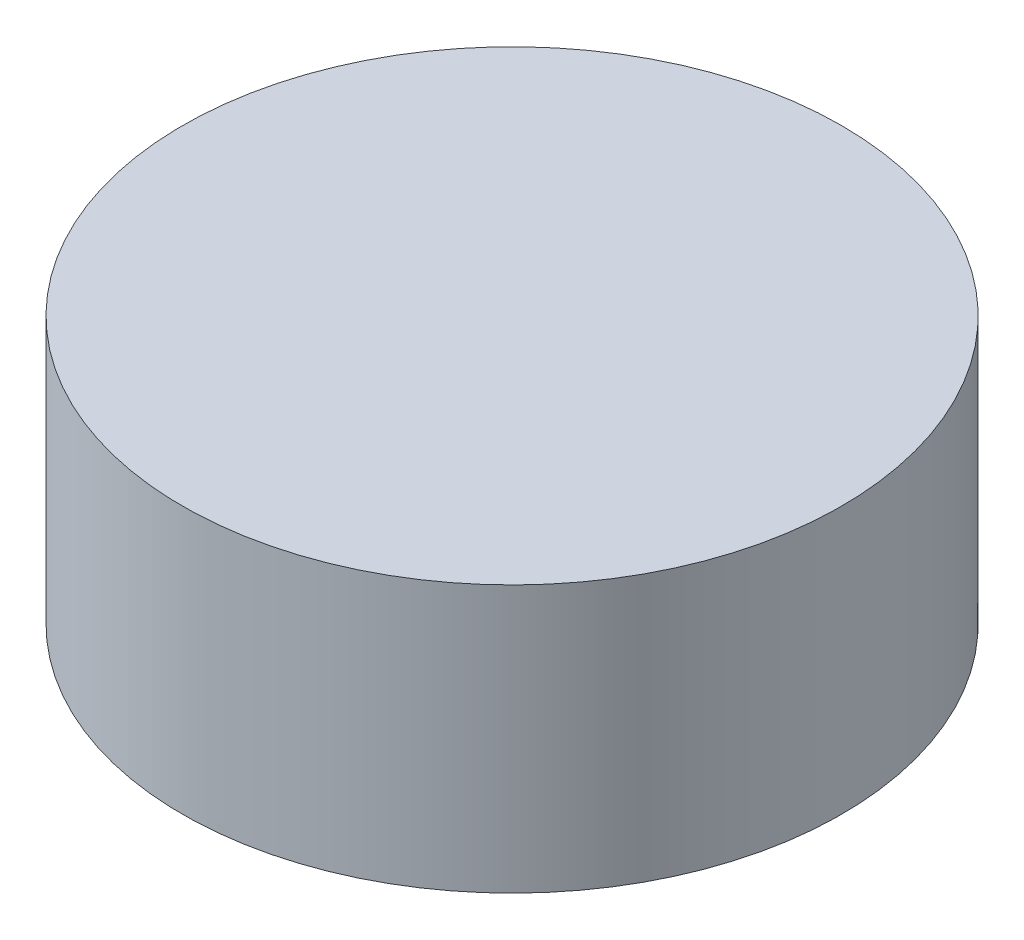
ISO-10303-21;
HEADER;
FILE_DESCRIPTION(('STEP AP214'),'2;1');
FILE_NAME('part.step','',(''),(''),'','','');
FILE_SCHEMA(('AUTOMOTIVE_DESIGN { 1 0 10303 214 1 1 1 1 }'));
ENDSEC;
DATA;
#1=APPLICATION_CONTEXT('core data for automotive mechanical design processes');
#2=APPLICATION_PROTOCOL_DEFINITION('international standard','automotive_design',2000,#1);
#3=PRODUCT_CONTEXT('',#1,'mechanical');
#4=PRODUCT('Part','Part','',(#3));
#5=PRODUCT_RELATED_PRODUCT_CATEGORY('part','',(#4));
#6=PRODUCT_DEFINITION_FORMATION('','',#4);
#7=PRODUCT_DEFINITION_CONTEXT('part definition',#1,'design');
#8=PRODUCT_DEFINITION('design','',#6,#7);
#9=PRODUCT_DEFINITION_SHAPE('','',#8);
#10=(LENGTH_UNIT() NAMED_UNIT(*) SI_UNIT(.MILLI.,.METRE.));
#11=(NAMED_UNIT(*) PLANE_ANGLE_UNIT() SI_UNIT($,.RADIAN.));
#12=(NAMED_UNIT(*) SI_UNIT($,.STERADIAN.) SOLID_ANGLE_UNIT());
#13=UNCERTAINTY_MEASURE_WITH_UNIT(LENGTH_MEASURE(1.E-05),#10,'distance_accuracy_value','');
#14=(GEOMETRIC_REPRESENTATION_CONTEXT(3) GLOBAL_UNCERTAINTY_ASSIGNED_CONTEXT((#13)) GLOBAL_UNIT_ASSIGNED_CONTEXT((#10,
#11,#12)) REPRESENTATION_CONTEXT('',''));
#15=CARTESIAN_POINT('',(0.,0.,0.));
#16=DIRECTION('',(0.,0.,1.));
#17=DIRECTION('',(1.,0.,0.));
#18=AXIS2_PLACEMENT_3D('',#15,#16,#17);
#19=CARTESIAN_POINT('',(0.,9.99999999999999,0.));
#20=DIRECTION('',(0.,-1.,0.));
#21=DIRECTION('',(0.,0.,-1.));
#22=AXIS2_PLACEMENT_3D('',#19,#20,#21);
#23=DEGENERATE_TOROIDAL_SURFACE('',#22,5.31967132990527,9.99999999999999,.T.);
#24=CARTESIAN_POINT('',(0.,0.142186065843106,0.));
#25=DIRECTION('',(0.,-1.,0.));
#26=DIRECTION('',(0.,0.,-1.));
#27=AXIS2_PLACEMENT_3D('',#24,#25,#26);
#28=CIRCLE('',#27,7.);
#29=CARTESIAN_POINT('',(0.,0.142186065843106,-7.));
#30=VERTEX_POINT('',#29);
#31=EDGE_CURVE('E10',#30,#30,#28,.T.);
#32=ORIENTED_EDGE('',*,*,#31,.T.);
#33=EDGE_LOOP('',(#32));
#34=FACE_BOUND('',#33,.T.);
#35=CARTESIAN_POINT('',(0.,0.,0.));
#36=DIRECTION('',(0.,-1.,0.));
#37=DIRECTION('',(0.,0.,-1.));
#38=AXIS2_PLACEMENT_3D('',#35,#36,#37);
#39=CIRCLE('',#38,5.31967132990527);
#40=CARTESIAN_POINT('',(0.,0.,-5.31967132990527));
#41=VERTEX_POINT('',#40);
#42=EDGE_CURVE('E45',#41,#41,#39,.T.);
#43=ORIENTED_EDGE('',*,*,#42,.F.);
#44=EDGE_LOOP('',(#43));
#45=FACE_BOUND('',#44,.T.);
#46=ADVANCED_FACE('F31',(#34,#45),#23,.T.);
#47=CARTESIAN_POINT('',(0.,0.,0.));
#48=DIRECTION('',(0.,-1.,0.));
#49=DIRECTION('',(0.,0.,-1.));
#50=AXIS2_PLACEMENT_3D('',#47,#48,#49);
#51=CYLINDRICAL_SURFACE('',#50,7.);
#52=CARTESIAN_POINT('',(0.,5.81154706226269,0.));
#53=DIRECTION('',(0.,-1.,0.));
#54=DIRECTION('',(0.,0.,-1.));
#55=AXIS2_PLACEMENT_3D('',#52,#53,#54);
#56=CIRCLE('',#55,7.);
#57=CARTESIAN_POINT('',(0.,5.81154706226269,-7.));
#58=VERTEX_POINT('',#57);
#59=EDGE_CURVE('E37',#58,#58,#56,.T.);
#60=ORIENTED_EDGE('',*,*,#59,.T.);
#61=EDGE_LOOP('',(#60));
#62=FACE_BOUND('',#61,.T.);
#63=ORIENTED_EDGE('',*,*,#31,.F.);
#64=EDGE_LOOP('',(#63));
#65=FACE_BOUND('',#64,.T.);
#66=ADVANCED_FACE('F55',(#62,#65),#51,.T.);
#67=CARTESIAN_POINT('',(7.,5.81154706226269,0.));
#68=DIRECTION('',(0.,1.,0.));
#69=DIRECTION('',(0.,0.,1.));
#70=AXIS2_PLACEMENT_3D('',#67,#68,#69);
#71=PLANE('',#70);
#72=ORIENTED_EDGE('',*,*,#59,.F.);
#73=EDGE_LOOP('',(#72));
#74=FACE_BOUND('',#73,.T.);
#75=ADVANCED_FACE('F59',(#74),#71,.T.);
#76=CARTESIAN_POINT('',(0.,1.3115470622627,0.));
#77=DIRECTION('',(0.,-1.,0.));
#78=DIRECTION('',(-1.,0.,0.));
#79=AXIS2_PLACEMENT_3D('',#76,#77,#78);
#80=SPHERICAL_SURFACE('',#79,2.5);
#81=CARTESIAN_POINT('',(0.,-0.95076235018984,0.));
#82=DIRECTION('',(0.,-1.,0.));
#83=DIRECTION('',(0.,0.,-1.));
#84=AXIS2_PLACEMENT_3D('',#81,#82,#83);
#85=CIRCLE('',#84,1.06393426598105);
#86=CARTESIAN_POINT('',(0.,-0.95076235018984,-1.06393426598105));
#87=VERTEX_POINT('',#86);
#88=EDGE_CURVE('E41',#87,#87,#85,.T.);
#89=ORIENTED_EDGE('',*,*,#88,.T.);
#90=EDGE_LOOP('',(#89));
#91=FACE_BOUND('',#90,.T.);
#92=ADVANCED_FACE('F63',(#91),#80,.T.);
#93=CARTESIAN_POINT('',(0.,-10.,0.));
#94=DIRECTION('',(0.,-1.,0.));
#95=DIRECTION('',(0.,0.,-1.));
#96=AXIS2_PLACEMENT_3D('',#93,#94,#95);
#97=DEGENERATE_TOROIDAL_SURFACE('',#96,5.31967132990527,10.,.T.);
#98=ORIENTED_EDGE('',*,*,#42,.T.);
#99=EDGE_LOOP('',(#98));
#100=FACE_BOUND('',#99,.T.);
#101=ORIENTED_EDGE('',*,*,#88,.F.);
#102=EDGE_LOOP('',(#101));
#103=FACE_BOUND('',#102,.T.);
#104=ADVANCED_FACE('F51',(#100,#103),#97,.F.);
#105=CLOSED_SHELL('',(#46,#66,#75,#92,#104));
#106=MANIFOLD_SOLID_BREP('B2',#105);
#107=ADVANCED_BREP_SHAPE_REPRESENTATION('',(#18,#106),#14);
#108=SHAPE_DEFINITION_REPRESENTATION(#9,#107);
ENDSEC;
END-ISO-10303-21;
